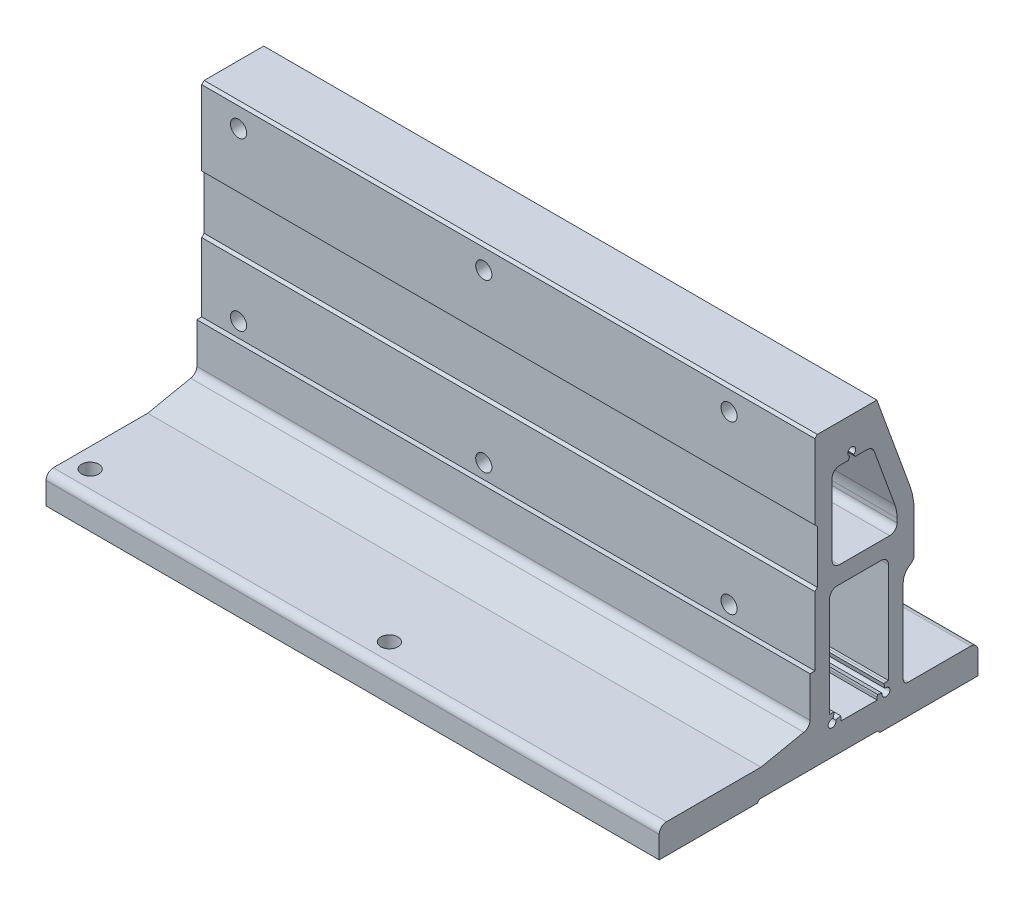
from build123d import *

# Parameters (mm, degrees)
EXTRUDE_1_DEPTH              = 125
HOLE_WIZARD_M6_1_D           = 6.6
HOLE_WIZARD_M6_1_CBORE_D     = 11
HOLE_WIZARD_M6_1_CBORE_DEPTH = 34.5
PATTERN_LINEAR_1_COUNT       = 3
PATTERN_LINEAR_1_PITCH       = 100
HOLE_WIZARD_M4_1_D           = 3.3
HOLE_WIZARD_M4_1_DEPTH       = 10
HOLE_WIZARD_M4_1_CSINK_D     = 4.05
HOLE_WIZARD_M4_1_CSINK_ANGLE = 90
HOLE_WIZARD_M4_1_TIP         = 0.991420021
F_5_0MM_1_D                  = 5
F_5_0MM_1_DEPTH              = 10
F_5_0MM_1_TIP                = 1.502151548
HOLE_WIZARD_7_0_7_1_D        = 7


with BuildPart() as part:
    # Sketch 1 → Extrude 1 (new, symmetric)
    with BuildSketch(Plane(origin=(0, 0, 0), x_dir=(0, 0, -1), z_dir=(1, 0, 0))):
        with BuildLine():
            Line((-1.5, 116), (-0.5, 117))
            Line((-0.5, 117), (23.753689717, 117))
            Line((23.753689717, 117), (37.190778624, 80.081901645))
            ThreePointArc((37.190778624, 80.081901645), (38.54423259, 75.030742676), (39, 69.821297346))
            Line((39, 69.821297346), (39, 54.794228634))
            ThreePointArc((39, 54.794228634), (38.598076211, 53.294228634), (37.5, 52.196152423))
            ThreePointArc((37.5, 52.196152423), (35.303847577, 50), (34.5, 47))
            Line((34.5, 47), (34.5, 13))
            ThreePointArc((34.5, 13), (35.085786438, 11.585786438), (36.5, 11))
            Line((36.5, 11), (62, 11))
            ThreePointArc((62, 11), (64.121320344, 10.121320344), (65, 8))
            Line((65, 8), (65, -1))
            Line((65, -1), (25, -1))
            Line((25, -1), (24, 0))
            Line((24, 0), (-24, 0))
            Line((-24, 0), (-25, -1))
            Line((-25, -1), (-65, -1))
            Line((-65, -1), (-65, 8))
            ThreePointArc((-65, 8), (-64.121320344, 10.121320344), (-62, 11))
            Line((-62, 11), (-23.5, 11))
            Line((-23.5, 11), (-6.035096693, 14.602337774))
            ThreePointArc((-6.035096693, 14.602337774), (-4.220229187, 15.616059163), (-3.5, 17.566096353))
            Line((-3.5, 17.566096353), (-3.5, 34))
            Line((-3.5, 34), (-1.5, 34))
            Line((-1.5, 34), (-1.5, 62))
            Line((-1.5, 62), (-0.5, 63))
            Line((-0.5, 63), (-0.5, 84.5))
            Line((-0.5, 84.5), (-1.5, 85.5))
            Line((-1.5, 85.5), (-1.5, 116))
        make_face()
        with BuildLine():
            Line((22.664439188, 99.52606043), (31.095389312, 76.362215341))
            ThreePointArc((31.095389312, 76.362215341), (31.772116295, 73.836635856), (32, 71.231913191))
            Line((32, 71.231913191), (32, 69.5))
            ThreePointArc((32, 69.5), (31.121320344, 67.378679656), (29, 66.5))
            Line((29, 66.5), (8.5, 66.5))
            ThreePointArc((8.5, 66.5), (6.378679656, 67.378679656), (5.5, 69.5))
            Line((5.5, 69.5), (5.5, 98.5))
            ThreePointArc((5.5, 98.5), (6.378679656, 100.621320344), (8.5, 101.5))
            Line((8.5, 101.5), (12.056626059, 101.5))
            Line((12.056626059, 101.5), (12.7, 102.614356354))
            ThreePointArc((12.7, 102.614356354), (13.5, 105.599997), (14.3, 102.614356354))
            Line((14.3, 102.614356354), (14.943373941, 101.5))
            Line((14.943373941, 101.5), (19.845361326, 101.5))
            ThreePointArc((19.845361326, 101.5), (21.566090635, 100.957456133), (22.664439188, 99.52606043))
        make_face(mode=Mode.SUBTRACT)
        with BuildLine():
            Line((28.5, 15.6), (28.5, 56.5))
            ThreePointArc((28.5, 56.5), (27.621320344, 58.621320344), (25.5, 59.5))
            Line((25.5, 59.5), (7.5, 59.5))
            ThreePointArc((7.5, 59.5), (5.378679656, 58.621320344), (4.5, 56.5))
            Line((4.5, 56.5), (4.5, 15.6))
            Line((4.5, 15.6), (5.5, 15.6))
            ThreePointArc((5.5, 15.6), (5.969894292, 15.569201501), (6.431748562, 15.477332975))
            Line((6.431748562, 15.477332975), (5.914110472, 13.545481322))
            ThreePointArc((5.914110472, 13.545481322), (4.36862915, 10.86862915), (7.045481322, 12.414110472))
            Line((7.045481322, 12.414110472), (8.977332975, 12.931748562))
            ThreePointArc((8.977332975, 12.931748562), (9.069201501, 12.469894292), (9.1, 12))
            Line((9.1, 12), (9.1, 11))
            Line((9.1, 11), (23.9, 11))
            Line((23.9, 11), (23.9, 12))
            ThreePointArc((23.9, 12), (23.930798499, 12.469894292), (24.022667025, 12.931748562))
            Line((24.022667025, 12.931748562), (25.954518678, 12.414110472))
            ThreePointArc((25.954518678, 12.414110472), (28.63137085, 10.86862915), (27.085889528, 13.545481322))
            Line((27.085889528, 13.545481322), (26.568251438, 15.477332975))
            ThreePointArc((26.568251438, 15.477332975), (27.030105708, 15.569201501), (27.5, 15.6))
            Line((27.5, 15.6), (28.5, 15.6))
        make_face(mode=Mode.SUBTRACT)
    extrude(amount=EXTRUDE_1_DEPTH, both=True)

    # Hole Wizard M6 _ _ _ _ _1 (through all)
    with Locations(Plane(origin=(0, 0, -39), x_dir=(-1, 0, 0), z_dir=(0, 0, -1))):
        with Locations((-90, 108), (-90, 40)):
            hole_wizard_m6_1 = CounterBoreHole(HOLE_WIZARD_M6_1_D / 2, HOLE_WIZARD_M6_1_CBORE_D / 2, HOLE_WIZARD_M6_1_CBORE_DEPTH)

    # Pattern Linear 1: Hole Wizard M6 _ _ _ _ _1 ×3
    with Locations(*[(-i * PATTERN_LINEAR_1_PITCH, 0, 0) for i in range(1, PATTERN_LINEAR_1_COUNT)]):
        add(hole_wizard_m6_1, mode=Mode.SUBTRACT)

    # Hole Wizard M4 _ _1
    with Locations(Plane.ZY.offset(125)):
        with Locations((-37, 5), (-9, 5)):
            CounterSinkHole(HOLE_WIZARD_M4_1_D / 2, HOLE_WIZARD_M4_1_CSINK_D / 2, depth=HOLE_WIZARD_M4_1_DEPTH, counter_sink_angle=HOLE_WIZARD_M4_1_CSINK_ANGLE)
            with Locations((0, 0, -(HOLE_WIZARD_M4_1_DEPTH + HOLE_WIZARD_M4_1_TIP / 2))):  # 118° drill point
                Cone(0, HOLE_WIZARD_M4_1_D / 2, HOLE_WIZARD_M4_1_TIP, mode=Mode.SUBTRACT)

    # 5.0mm _ _1
    with Locations(Plane(origin=(0, 0, 0), x_dir=(-1, 0, 0), z_dir=(0, -1, 0))):
        with Locations((-5, 0), (117, 0)):
            Hole(F_5_0MM_1_D / 2, depth=F_5_0MM_1_DEPTH)
            with Locations((0, 0, -(F_5_0MM_1_DEPTH + F_5_0MM_1_TIP / 2))):  # 118° drill point
                Cone(0, F_5_0MM_1_D / 2, F_5_0MM_1_TIP, mode=Mode.SUBTRACT)

    # Hole Wizard 7.0 _7_ _ _1 (through all)
    with Locations(Plane(origin=(0, -1, 0), x_dir=(-1, 0, 0), z_dir=(0, -1, 0))):
        with Locations((117, -55), (-5, -55), (117, 55), (-5, 55)):
            Hole(HOLE_WIZARD_7_0_7_1_D / 2)


solid = part.part
